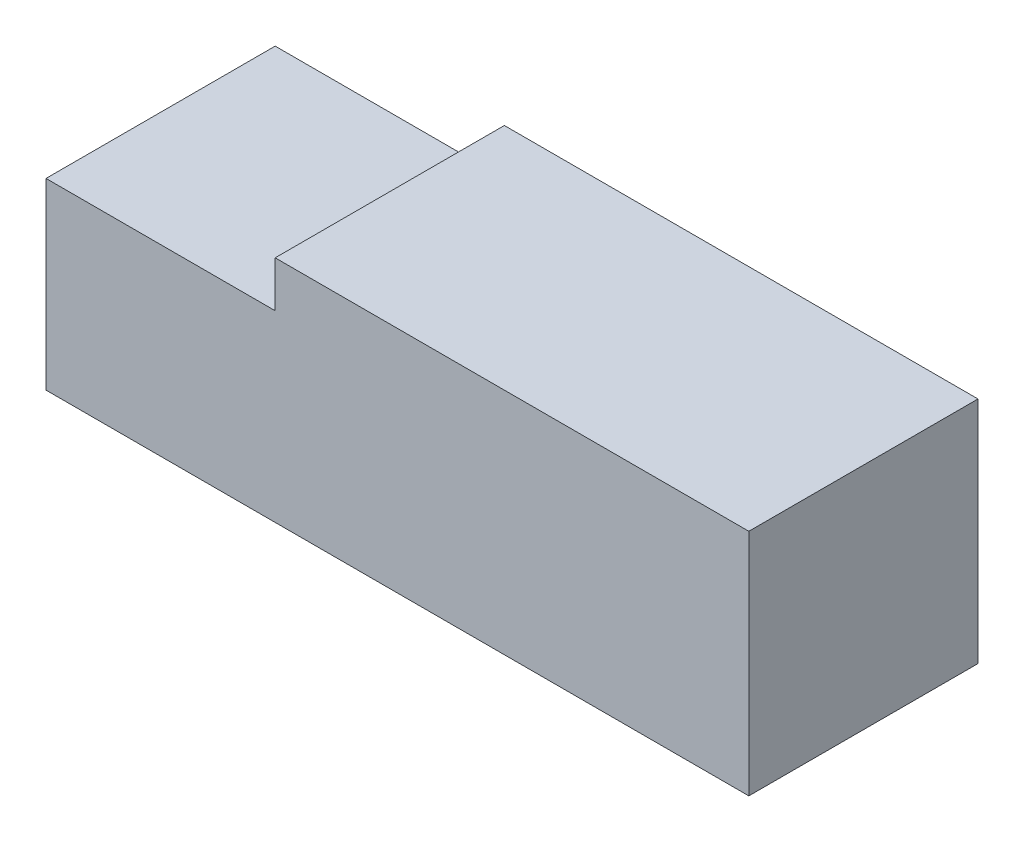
from build123d import *

# Parameters (mm, degrees)
SKETCH1_W           = 230
SKETCH1_H           = 115
BOSS_EXTRUDE1_DEPTH = 37.5
SKETCH2_W           = 75
SKETCH2_H           = 115
CUT_EXTRUDE1_DEPTH  = 15
CUT_EXTRUDE2_DEPTH  = 40


with BuildPart() as part:
    # Sketch1 → Boss-Extrude1 (new, symmetric)
    with BuildSketch(Plane(origin=(0, 0, 0), x_dir=(1, 0, 0), z_dir=(0, 1, 0))):
        Rectangle(SKETCH1_W, SKETCH1_H)
    extrude(amount=BOSS_EXTRUDE1_DEPTH, both=True)

    # Sketch2 → Cut-Extrude1 (cut)
    with BuildSketch(Plane(origin=(0, 37.5, 0), x_dir=(1, 0, 0), z_dir=(0, 1, 0))):
        with Locations((-77.5, 0)):
            Rectangle(SKETCH2_W, SKETCH2_H)
    extrude(amount=-CUT_EXTRUDE1_DEPTH, mode=Mode.SUBTRACT)

    # Sketch4 → Cut-Extrude2 (cut)
    with BuildSketch(Plane.XY.offset(57.5)):
        Polygon((-115, 22.5), (-115, -37.5), (115, -37.5), (115, 37.5), (-40, 37.5), (-40, 22.5), align=None)
    extrude(amount=-CUT_EXTRUDE2_DEPTH, mode=Mode.SUBTRACT)


solid = part.part
